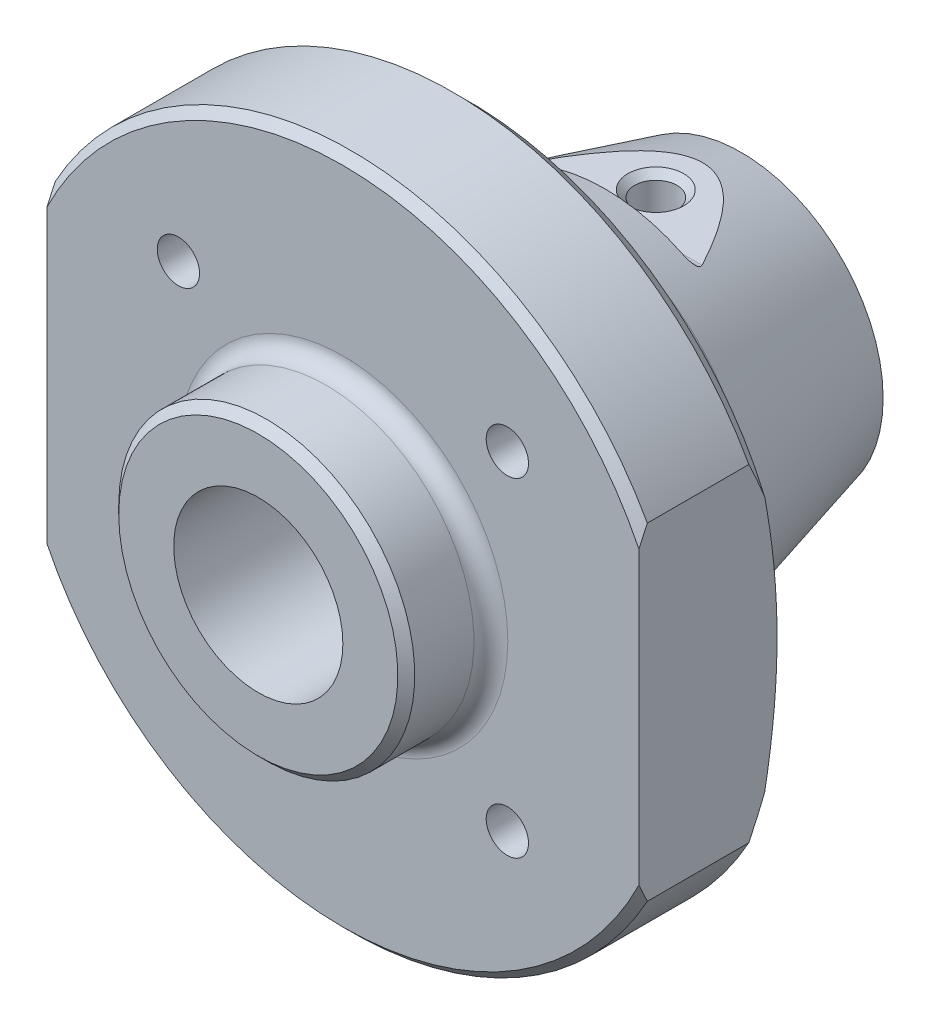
from build123d import *
from OCP.BRepFilletAPI import BRepFilletAPI_MakeChamfer

# Parameters (mm, degrees)
SKETCH3_OUTSIDE_W       = 107.612
SKETCH3_OUTSIDE_H       = 107.612
SKETCH3_OUTSIDE_W_2     = 70
SKETCH3_OUTSIDE_H_2     = 90
CUT_EXTRUDE1_DEPTH      = 76.498344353
CIRPATTERN1_COUNT       = 4
SKETCH6_R               = 10
CUT_EXTRUDE2_DEPTH      = 50
FILLET1_R               = 10
CHAMFER1_SIZE           = 3
CHAMFER1_SIZE2          = 4.242640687
CHAMFER2_SIZE           = 1
CHAMFER2_SIZE2          = 2.067441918
CHAMFER3_SIZE           = 1
FILLET3_R               = 2
CUT_EXTRUDE3_DEPTH      = 81.156097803
CUT_EXTRUDE3_DEPTH_BACK = 81.156097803
CUT_EXTRUDE4_REACH      = 92.493
CUT_EXTRUDE4_END_RADIUS = 10
SKETCH9_R               = 2.5
CHAMFER4_SIZE           = 0.8


with BuildPart() as part:
    # Sketch2 → Revolve1 (revolve)
    with BuildSketch(Plane(origin=(0, 0, 0), x_dir=(1, 0, 0), z_dir=(0, 1, 0)), mode=Mode.PRIVATE) as revolve1_sk:
        Polygon((0, 0), (17.5, 0), (17.5, 10), (40, 10), (40, 24), (23.596621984, 31.649020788), (16, 60), (0, 60), align=None)
    revolve(revolve1_sk.sketch.rotate(Axis((0, 0, 0), (0, 0, 1)), 180), axis=Axis((0, 0, 0), (0, 0, 1)))

    # Sketch3 outside → Cut-Extrude1 (cut, through all)
    with BuildSketch(Plane.XY.offset(-10)):
        Rectangle(SKETCH3_OUTSIDE_W, SKETCH3_OUTSIDE_H)
        Rectangle(SKETCH3_OUTSIDE_W_2, SKETCH3_OUTSIDE_H_2, mode=Mode.SUBTRACT)
    extrude(amount=-CUT_EXTRUDE1_DEPTH, mode=Mode.SUBTRACT)

    # Sketch4 → M6 Tapped Hole1 (revolve, cut)
    with BuildSketch(Plane(origin=(19.445436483, 19.445436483, -10), x_dir=(0, -1, 0), z_dir=(1, 0, 0))):
        Polygon((0, 0), (0, 16.502151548), (2.5, 15), (2.5, 0), align=None)
    m6_tapped_hole1 = revolve(axis=Axis((19.445436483, 19.445436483, -3.65), (0, 0, -1)), mode=Mode.SUBTRACT)

    # CirPattern1: M6 Tapped Hole1 ×4 about axis
    cirpattern1_axis = Axis((0, 0, 0), (0, 0, 1))
    for i in range(1, CIRPATTERN1_COUNT):
        add(m6_tapped_hole1.rotate(cirpattern1_axis, i * 360 / CIRPATTERN1_COUNT), mode=Mode.SUBTRACT)

    # Sketch6 → Cut-Extrude2 (cut)
    with BuildSketch(Plane.XY):
        Circle(SKETCH6_R)
    extrude(amount=-CUT_EXTRUDE2_DEPTH, mode=Mode.SUBTRACT)

    # Fillet1
    fillet1_edges = [part.edges().sort_by_distance(p)[0] for p in [
        (23.596621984, 0, -31.649020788),
    ]]
    fillet(fillet1_edges, radius=FILLET1_R)

    # Chamfer1
    chamfer1_edges = [part.edges().sort_by_distance(p)[0] for p in [
        (16, 0, -60),
    ]]
    chamfer1_side = [part.faces().sort_by_distance(p)[0] for p in [
        (19.194864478, 0, -48.076603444),
    ]]
    chamfer(chamfer1_edges, length=CHAMFER1_SIZE, length2=CHAMFER1_SIZE2, reference=chamfer1_side[0])

    # Chamfer2: one chamfer whose edges measure the first distance from different faces: ONE call of the kernel's chamfer builder (chamfer() names one face for all edges)
    chamfer2_edges_1 = [part.edges().sort_by_distance(p)[0] for p in [
        (0, 40, -10),
        (0, -40, -10),
    ]]
    chamfer2_edges_2 = [part.edges().sort_by_distance(p)[0] for p in [
        (0, -40, -24),
    ]]
    chamfer2_side_2 = [part.faces().sort_by_distance(p)[0] for p in [
        (0, -40, -17),
    ]]
    chamfer2_edges_3 = [part.edges().sort_by_distance(p)[0] for p in [
        (0, 40, -24),
    ]]
    chamfer2_side_3 = [part.faces().sort_by_distance(p)[0] for p in [
        (0, 40, -17),
    ]]
    chamfer2 = BRepFilletAPI_MakeChamfer(part.part.solid().wrapped)
    for e in chamfer2_edges_1:
        chamfer2.Add(CHAMFER2_SIZE, e.wrapped)
    for e in chamfer2_edges_2:
        chamfer2.Add(CHAMFER2_SIZE, CHAMFER2_SIZE2, e.wrapped, chamfer2_side_2[0].wrapped)  # the first distance lies on this face
    for e in chamfer2_edges_3:
        chamfer2.Add(CHAMFER2_SIZE, CHAMFER2_SIZE2, e.wrapped, chamfer2_side_3[0].wrapped)  # the first distance lies on this face
    add(Compound.cast(chamfer2.Shape()), mode=Mode.REPLACE)

    # Chamfer3
    chamfer3_edges = [part.edges().sort_by_distance(p)[0] for p in [
        (17.5, 0, 0),
    ]]
    chamfer(chamfer3_edges, length=CHAMFER3_SIZE)

    # Fillet3
    fillet3_edges = [part.edges().sort_by_distance(p)[0] for p in [
        (17.5, 0, -10),
    ]]
    fillet(fillet3_edges, radius=FILLET3_R)

    # Sketch8 → Cut-Extrude3 (cut, two sides: drawn at the far end of the back side and taken through both)
    with BuildSketch(Plane(origin=(0, 0, 0), x_dir=(0, 0, -1), z_dir=(1, 0, 0)).offset(-CUT_EXTRUDE3_DEPTH_BACK)):
        with BuildLine():
            Line((236.901168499, 18), (60, 18))
            Line((60, 18), (42, 18))
            ThreePointArc((42, 18), (41.292893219, 18.292893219), (41, 19))
            Line((41, 19), (41, 24))
            Line((41, 24), (41, 200.901168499))
            Line((41, 200.901168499), (282.44817433, 459.510667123))
            Line((282.44817433, 459.510667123), (478.349342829, 276.609498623))
            Line((478.349342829, 276.609498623), (236.901168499, 18))
        make_face()
    extrude(amount=CUT_EXTRUDE3_DEPTH + CUT_EXTRUDE3_DEPTH_BACK, mode=Mode.SUBTRACT)

    # Cut-Extrude4: up to this cylinder (the profile starts outside it)
    cut_extrude4_end = Plane(origin=(0, 0, -47), z_dir=(0, 0, 1)) * Cylinder(CUT_EXTRUDE4_END_RADIUS, 205.986, mode=Mode.PRIVATE)
    # Sketch9 → Cut-Extrude4 (cut, up to the surface)
    with BuildSketch(Plane(origin=(0, 18, 0), x_dir=(1, 0, 0), z_dir=(0, 1, 0)), mode=Mode.PRIVATE) as cut_extrude4_sk1:
        with Locations(Location((0, 47, 0), (0, 0, 270))):
            Circle(SKETCH9_R)
    cut_extrude4_tool1 = extrude(cut_extrude4_sk1.sketch, amount=-CUT_EXTRUDE4_REACH, mode=Mode.PRIVATE) - cut_extrude4_end
    add(cut_extrude4_tool1.solids().sort_by_distance((0, 18, -47))[0], mode=Mode.SUBTRACT)

    # Chamfer4
    chamfer4_edges = [part.edges().sort_by_distance(p)[0] for p in [
        (0, 18, -49.5),
    ]]
    chamfer(chamfer4_edges, length=CHAMFER4_SIZE)


solid = part.part
